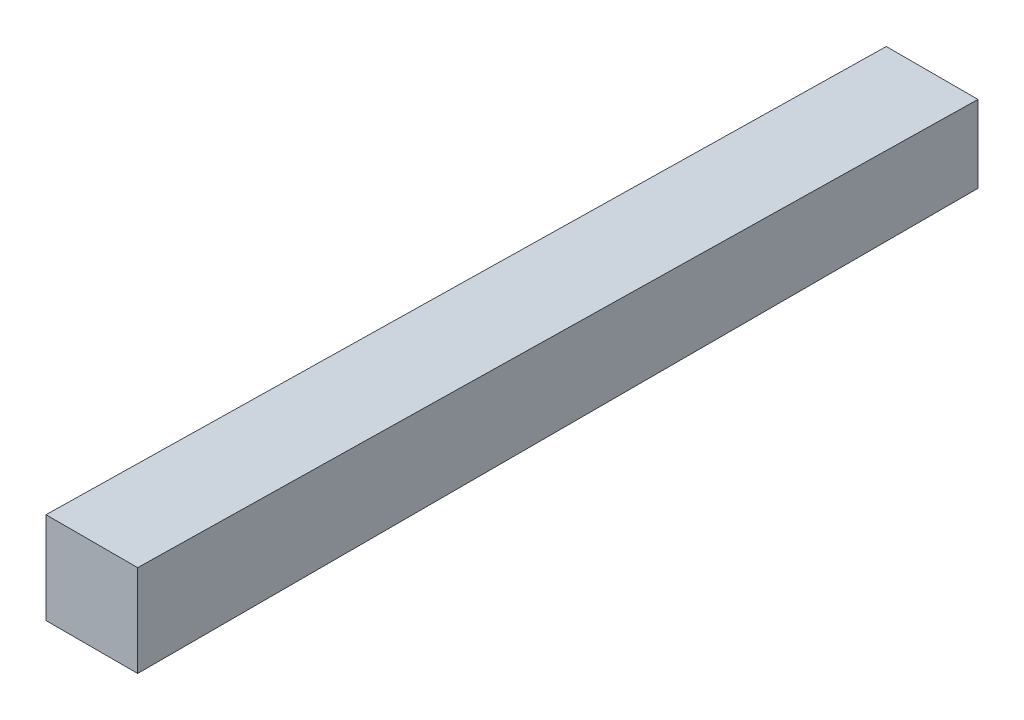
from build123d import *

# Parameters (mm, degrees)
SKETCH1_W           = 6
SKETCH1_H           = 6
BOSS_EXTRUDE1_DEPTH = 55
DRAFT1_ANGLE        = -1


with BuildPart() as part:
    # Sketch1 → Boss-Extrude1 (new body)
    with BuildSketch(Plane.XY):
        Rectangle(SKETCH1_W, SKETCH1_H)
    extrude(amount=BOSS_EXTRUDE1_DEPTH)

    # Draft1
    draft1_faces = [part.faces().sort_by_distance(p)[0] for p in [
        (0, 3, 27.5),
    ]]
    draft(draft1_faces, Plane.XY.offset(55), DRAFT1_ANGLE)


solid = part.part
